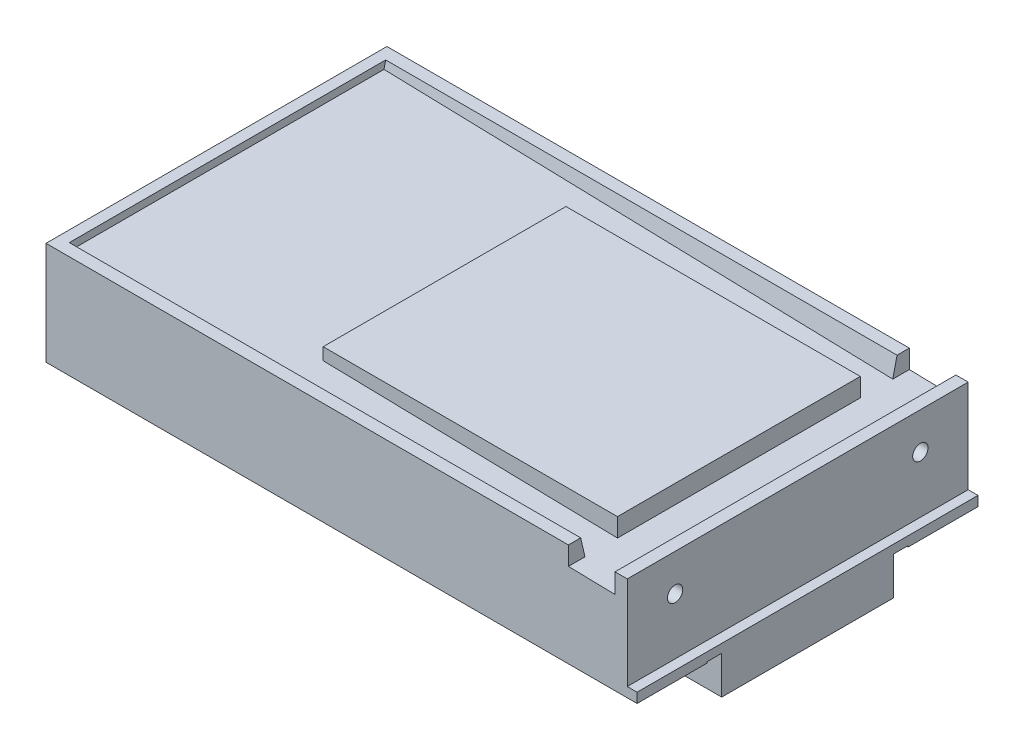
ISO-10303-21;
HEADER;
FILE_DESCRIPTION(('STEP AP214'),'2;1');
FILE_NAME('part.step','',(''),(''),'','','');
FILE_SCHEMA(('AUTOMOTIVE_DESIGN { 1 0 10303 214 1 1 1 1 }'));
ENDSEC;
DATA;
#1=APPLICATION_CONTEXT('core data for automotive mechanical design processes');
#2=APPLICATION_PROTOCOL_DEFINITION('international standard','automotive_design',2000,#1);
#3=PRODUCT_CONTEXT('',#1,'mechanical');
#4=PRODUCT('Part','Part','',(#3));
#5=PRODUCT_RELATED_PRODUCT_CATEGORY('part','',(#4));
#6=PRODUCT_DEFINITION_FORMATION('','',#4);
#7=PRODUCT_DEFINITION_CONTEXT('part definition',#1,'design');
#8=PRODUCT_DEFINITION('design','',#6,#7);
#9=PRODUCT_DEFINITION_SHAPE('','',#8);
#10=(LENGTH_UNIT() NAMED_UNIT(*) SI_UNIT(.MILLI.,.METRE.));
#11=(NAMED_UNIT(*) PLANE_ANGLE_UNIT() SI_UNIT($,.RADIAN.));
#12=(NAMED_UNIT(*) SI_UNIT($,.STERADIAN.) SOLID_ANGLE_UNIT());
#13=UNCERTAINTY_MEASURE_WITH_UNIT(LENGTH_MEASURE(1.E-05),#10,'distance_accuracy_value','');
#14=(GEOMETRIC_REPRESENTATION_CONTEXT(3) GLOBAL_UNCERTAINTY_ASSIGNED_CONTEXT((#13)) GLOBAL_UNIT_ASSIGNED_CONTEXT((#10,
#11,#12)) REPRESENTATION_CONTEXT('',''));
#15=CARTESIAN_POINT('',(0.,0.,0.));
#16=DIRECTION('',(0.,0.,1.));
#17=DIRECTION('',(1.,0.,0.));
#18=AXIS2_PLACEMENT_3D('',#15,#16,#17);
#19=CARTESIAN_POINT('',(93.,57.,-69.5));
#20=DIRECTION('',(-1.,0.,0.));
#21=DIRECTION('',(0.,-1.,0.));
#22=AXIS2_PLACEMENT_3D('',#19,#20,#21);
#23=PLANE('',#22);
#24=DIRECTION('',(0.,0.,1.));
#25=VECTOR('',#24,1.);
#26=CARTESIAN_POINT('',(93.,57.,-69.5));
#27=LINE('',#26,#25);
#28=CARTESIAN_POINT('',(93.,57.,-49.5));
#29=VERTEX_POINT('',#28);
#30=CARTESIAN_POINT('',(93.,57.,49.5));
#31=VERTEX_POINT('',#30);
#32=EDGE_CURVE('E865',#29,#31,#27,.T.);
#33=ORIENTED_EDGE('',*,*,#32,.F.);
#34=DIRECTION('',(0.,-1.,0.));
#35=VECTOR('',#34,1.);
#36=CARTESIAN_POINT('',(93.,57.,-49.5));
#37=LINE('',#36,#35);
#38=CARTESIAN_POINT('',(93.,52.0549450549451,-49.5));
#39=VERTEX_POINT('',#38);
#40=EDGE_CURVE('E791',#29,#39,#37,.T.);
#41=ORIENTED_EDGE('',*,*,#40,.T.);
#42=DIRECTION('',(0.,0.,1.));
#43=VECTOR('',#42,1.);
#44=CARTESIAN_POINT('',(93.,52.0549450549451,-69.5));
#45=LINE('',#44,#43);
#46=CARTESIAN_POINT('',(93.,52.0549450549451,49.5));
#47=VERTEX_POINT('',#46);
#48=EDGE_CURVE('E863',#39,#47,#45,.T.);
#49=ORIENTED_EDGE('',*,*,#48,.T.);
#50=DIRECTION('',(0.,1.,0.));
#51=VECTOR('',#50,1.);
#52=CARTESIAN_POINT('',(93.,57.,49.5));
#53=LINE('',#52,#51);
#54=EDGE_CURVE('E803',#47,#31,#53,.T.);
#55=ORIENTED_EDGE('',*,*,#54,.T.);
#56=EDGE_LOOP('',(#33,#41,#49,#55));
#57=FACE_BOUND('',#56,.T.);
#58=ADVANCED_FACE('F356',(#57),#23,.T.);
#59=CARTESIAN_POINT('',(213.,57.,-69.5));
#60=DIRECTION('',(0.,1.,0.));
#61=DIRECTION('',(-1.,0.,0.));
#62=AXIS2_PLACEMENT_3D('',#59,#60,#61);
#63=PLANE('',#62);
#64=DIRECTION('',(0.,0.,1.));
#65=VECTOR('',#64,1.);
#66=CARTESIAN_POINT('',(213.,57.,-69.5));
#67=LINE('',#66,#65);
#68=CARTESIAN_POINT('',(213.,57.,-49.5));
#69=VERTEX_POINT('',#68);
#70=CARTESIAN_POINT('',(213.,57.,49.5));
#71=VERTEX_POINT('',#70);
#72=EDGE_CURVE('E867',#69,#71,#67,.T.);
#73=ORIENTED_EDGE('',*,*,#72,.F.);
#74=DIRECTION('',(-1.,0.,0.));
#75=VECTOR('',#74,1.);
#76=CARTESIAN_POINT('',(213.,57.,-49.5));
#77=LINE('',#76,#75);
#78=EDGE_CURVE('E788',#69,#29,#77,.T.);
#79=ORIENTED_EDGE('',*,*,#78,.T.);
#80=ORIENTED_EDGE('',*,*,#32,.T.);
#81=DIRECTION('',(1.,0.,0.));
#82=VECTOR('',#81,1.);
#83=CARTESIAN_POINT('',(213.,57.,49.5));
#84=LINE('',#83,#82);
#85=EDGE_CURVE('E800',#31,#71,#84,.T.);
#86=ORIENTED_EDGE('',*,*,#85,.T.);
#87=EDGE_LOOP('',(#73,#79,#80,#86));
#88=FACE_BOUND('',#87,.T.);
#89=ADVANCED_FACE('F936',(#88),#63,.T.);
#90=CARTESIAN_POINT('',(213.,49.4175824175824,-69.5));
#91=DIRECTION('',(1.,0.,0.));
#92=DIRECTION('',(0.,1.,0.));
#93=AXIS2_PLACEMENT_3D('',#90,#91,#92);
#94=PLANE('',#93);
#95=DIRECTION('',(0.,0.,1.));
#96=VECTOR('',#95,1.);
#97=CARTESIAN_POINT('',(213.,49.4175824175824,-69.5));
#98=LINE('',#97,#96);
#99=CARTESIAN_POINT('',(213.,49.4175824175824,-49.5));
#100=VERTEX_POINT('',#99);
#101=CARTESIAN_POINT('',(213.,49.4175824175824,49.5));
#102=VERTEX_POINT('',#101);
#103=EDGE_CURVE('E869',#100,#102,#98,.T.);
#104=ORIENTED_EDGE('',*,*,#103,.F.);
#105=DIRECTION('',(0.,1.,0.));
#106=VECTOR('',#105,1.);
#107=CARTESIAN_POINT('',(213.,49.4175824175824,-49.5));
#108=LINE('',#107,#106);
#109=EDGE_CURVE('E785',#100,#69,#108,.T.);
#110=ORIENTED_EDGE('',*,*,#109,.T.);
#111=ORIENTED_EDGE('',*,*,#72,.T.);
#112=DIRECTION('',(0.,-1.,0.));
#113=VECTOR('',#112,1.);
#114=CARTESIAN_POINT('',(213.,49.4175824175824,49.5));
#115=LINE('',#114,#113);
#116=EDGE_CURVE('E797',#71,#102,#115,.T.);
#117=ORIENTED_EDGE('',*,*,#116,.T.);
#118=EDGE_LOOP('',(#104,#110,#111,#117));
#119=FACE_BOUND('',#118,.T.);
#120=ADVANCED_FACE('F943',(#119),#94,.T.);
#121=CARTESIAN_POINT('',(241.,0.,69.5));
#122=DIRECTION('',(0.,0.,1.));
#123=DIRECTION('',(1.,0.,0.));
#124=AXIS2_PLACEMENT_3D('',#121,#122,#123);
#125=PLANE('',#124);
#126=DIRECTION('',(-1.,0.,0.));
#127=VECTOR('',#126,1.);
#128=CARTESIAN_POINT('',(241.,15.,69.5));
#129=LINE('',#128,#127);
#130=CARTESIAN_POINT('',(241.,15.,69.5));
#131=VERTEX_POINT('',#130);
#132=CARTESIAN_POINT('',(0.,15.,69.5));
#133=VERTEX_POINT('',#132);
#134=EDGE_CURVE('E729',#131,#133,#129,.T.);
#135=ORIENTED_EDGE('',*,*,#134,.F.);
#136=DIRECTION('',(0.,1.,0.));
#137=VECTOR('',#136,1.);
#138=CARTESIAN_POINT('',(241.,0.,69.5));
#139=LINE('',#138,#137);
#140=CARTESIAN_POINT('',(241.,19.,69.5));
#141=VERTEX_POINT('',#140);
#142=EDGE_CURVE('E806',#131,#141,#139,.T.);
#143=ORIENTED_EDGE('',*,*,#142,.T.);
#144=DIRECTION('',(-1.,0.,0.));
#145=VECTOR('',#144,1.);
#146=CARTESIAN_POINT('',(241.,19.,69.5));
#147=LINE('',#146,#145);
#148=CARTESIAN_POINT('',(237.,19.,69.5));
#149=VERTEX_POINT('',#148);
#150=EDGE_CURVE('E808',#141,#149,#147,.T.);
#151=ORIENTED_EDGE('',*,*,#150,.T.);
#152=DIRECTION('',(0.,1.,0.));
#153=VECTOR('',#152,1.);
#154=CARTESIAN_POINT('',(237.,19.,69.5));
#155=LINE('',#154,#153);
#156=CARTESIAN_POINT('',(237.,57.,69.5));
#157=VERTEX_POINT('',#156);
#158=EDGE_CURVE('E811',#149,#157,#155,.T.);
#159=ORIENTED_EDGE('',*,*,#158,.T.);
#160=DIRECTION('',(-1.,0.,0.));
#161=VECTOR('',#160,1.);
#162=CARTESIAN_POINT('',(237.,57.,69.5));
#163=LINE('',#162,#161);
#164=CARTESIAN_POINT('',(232.,57.,69.5));
#165=VERTEX_POINT('',#164);
#166=EDGE_CURVE('E814',#157,#165,#163,.T.);
#167=ORIENTED_EDGE('',*,*,#166,.T.);
#168=DIRECTION('',(0.,-1.,0.));
#169=VECTOR('',#168,1.);
#170=CARTESIAN_POINT('',(232.,57.,69.5));
#171=LINE('',#170,#169);
#172=CARTESIAN_POINT('',(232.,49.,69.5));
#173=VERTEX_POINT('',#172);
#174=EDGE_CURVE('E817',#165,#173,#171,.T.);
#175=ORIENTED_EDGE('',*,*,#174,.T.);
#176=DIRECTION('',(-0.999758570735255,0.0219727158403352,0.));
#177=VECTOR('',#176,1.);
#178=CARTESIAN_POINT('',(93.,52.0549450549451,69.5));
#179=LINE('',#178,#177);
#180=CARTESIAN_POINT('',(213.,49.4175824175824,69.5));
#181=VERTEX_POINT('',#180);
#182=EDGE_CURVE('E820',#173,#181,#179,.T.);
#183=ORIENTED_EDGE('',*,*,#182,.T.);
#184=DIRECTION('',(0.,1.,0.));
#185=VECTOR('',#184,1.);
#186=CARTESIAN_POINT('',(213.,44.,69.5));
#187=LINE('',#186,#185);
#188=CARTESIAN_POINT('',(213.,57.,69.5));
#189=VERTEX_POINT('',#188);
#190=EDGE_CURVE('E773',#181,#189,#187,.T.);
#191=ORIENTED_EDGE('',*,*,#190,.T.);
#192=DIRECTION('',(-1.,0.,0.));
#193=VECTOR('',#192,1.);
#194=CARTESIAN_POINT('',(4.5,57.,69.5));
#195=LINE('',#194,#193);
#196=CARTESIAN_POINT('',(0.,57.,69.5));
#197=VERTEX_POINT('',#196);
#198=EDGE_CURVE('E823',#189,#197,#195,.T.);
#199=ORIENTED_EDGE('',*,*,#198,.T.);
#200=DIRECTION('',(0.,-1.,0.));
#201=VECTOR('',#200,1.);
#202=CARTESIAN_POINT('',(0.,57.,69.5));
#203=LINE('',#202,#201);
#204=EDGE_CURVE('E826',#197,#133,#203,.T.);
#205=ORIENTED_EDGE('',*,*,#204,.T.);
#206=EDGE_LOOP('',(#135,#143,#151,#159,#167,#175,#183,#191,#199,#205));
#207=FACE_BOUND('',#206,.T.);
#208=ADVANCED_FACE('F953',(#207),#125,.T.);
#209=CARTESIAN_POINT('',(0.,0.,-69.5));
#210=DIRECTION('',(0.,-1.,0.));
#211=DIRECTION('',(0.,0.,-1.));
#212=AXIS2_PLACEMENT_3D('',#209,#210,#211);
#213=PLANE('',#212);
#214=CARTESIAN_POINT('',(229.,0.,-25.5));
#215=DIRECTION('',(0.,-1.,0.));
#216=DIRECTION('',(0.,0.,-1.));
#217=AXIS2_PLACEMENT_3D('',#214,#215,#216);
#218=CIRCLE('',#217,5.);
#219=CARTESIAN_POINT('',(229.,0.,-30.5));
#220=VERTEX_POINT('',#219);
#221=EDGE_CURVE('E606',#220,#220,#218,.T.);
#222=ORIENTED_EDGE('',*,*,#221,.F.);
#223=EDGE_LOOP('',(#222));
#224=FACE_BOUND('',#223,.T.);
#225=CARTESIAN_POINT('',(229.,0.,25.));
#226=DIRECTION('',(0.,-1.,0.));
#227=DIRECTION('',(0.,0.,-1.));
#228=AXIS2_PLACEMENT_3D('',#225,#226,#227);
#229=CIRCLE('',#228,5.);
#230=CARTESIAN_POINT('',(229.,0.,20.));
#231=VERTEX_POINT('',#230);
#232=EDGE_CURVE('E617',#231,#231,#229,.T.);
#233=ORIENTED_EDGE('',*,*,#232,.F.);
#234=EDGE_LOOP('',(#233));
#235=FACE_BOUND('',#234,.T.);
#236=DIRECTION('',(0.,0.,-1.));
#237=VECTOR('',#236,1.);
#238=CARTESIAN_POINT('',(213.3,0.,-29.));
#239=LINE('',#238,#237);
#240=CARTESIAN_POINT('',(213.3,0.,29.));
#241=VERTEX_POINT('',#240);
#242=CARTESIAN_POINT('',(213.3,0.,-29.));
#243=VERTEX_POINT('',#242);
#244=EDGE_CURVE('E671',#241,#243,#239,.T.);
#245=ORIENTED_EDGE('',*,*,#244,.T.);
#246=DIRECTION('',(-1.,0.,0.));
#247=VECTOR('',#246,1.);
#248=CARTESIAN_POINT('',(213.3,0.,-29.));
#249=LINE('',#248,#247);
#250=CARTESIAN_POINT('',(13.,0.,-29.));
#251=VERTEX_POINT('',#250);
#252=EDGE_CURVE('E707',#243,#251,#249,.T.);
#253=ORIENTED_EDGE('',*,*,#252,.T.);
#254=DIRECTION('',(0.,0.,-1.));
#255=VECTOR('',#254,1.);
#256=CARTESIAN_POINT('',(13.,0.,-29.));
#257=LINE('',#256,#255);
#258=CARTESIAN_POINT('',(13.,0.,29.));
#259=VERTEX_POINT('',#258);
#260=EDGE_CURVE('E651',#259,#251,#257,.T.);
#261=ORIENTED_EDGE('',*,*,#260,.F.);
#262=DIRECTION('',(-1.,0.,0.));
#263=VECTOR('',#262,1.);
#264=CARTESIAN_POINT('',(213.3,0.,29.));
#265=LINE('',#264,#263);
#266=EDGE_CURVE('E378',#241,#259,#265,.T.);
#267=ORIENTED_EDGE('',*,*,#266,.F.);
#268=EDGE_LOOP('',(#245,#253,#261,#267));
#269=FACE_BOUND('',#268,.T.);
#270=DIRECTION('',(1.,0.,0.));
#271=VECTOR('',#270,1.);
#272=CARTESIAN_POINT('',(0.,0.,35.));
#273=LINE('',#272,#271);
#274=CARTESIAN_POINT('',(0.,0.,35.));
#275=VERTEX_POINT('',#274);
#276=CARTESIAN_POINT('',(241.,0.,35.));
#277=VERTEX_POINT('',#276);
#278=EDGE_CURVE('E724',#275,#277,#273,.T.);
#279=ORIENTED_EDGE('',*,*,#278,.F.);
#280=DIRECTION('',(0.,0.,1.));
#281=VECTOR('',#280,1.);
#282=CARTESIAN_POINT('',(0.,0.,-69.5));
#283=LINE('',#282,#281);
#284=CARTESIAN_POINT('',(0.,0.,-35.));
#285=VERTEX_POINT('',#284);
#286=EDGE_CURVE('E853',#285,#275,#283,.T.);
#287=ORIENTED_EDGE('',*,*,#286,.F.);
#288=DIRECTION('',(-1.,0.,0.));
#289=VECTOR('',#288,1.);
#290=CARTESIAN_POINT('',(0.,0.,-35.));
#291=LINE('',#290,#289);
#292=CARTESIAN_POINT('',(241.,0.,-35.));
#293=VERTEX_POINT('',#292);
#294=EDGE_CURVE('E750',#293,#285,#291,.T.);
#295=ORIENTED_EDGE('',*,*,#294,.F.);
#296=DIRECTION('',(0.,0.,1.));
#297=VECTOR('',#296,1.);
#298=CARTESIAN_POINT('',(241.,0.,-69.5));
#299=LINE('',#298,#297);
#300=EDGE_CURVE('E852',#293,#277,#299,.T.);
#301=ORIENTED_EDGE('',*,*,#300,.T.);
#302=EDGE_LOOP('',(#279,#287,#295,#301));
#303=FACE_BOUND('',#302,.T.);
#304=ADVANCED_FACE('F358',(#224,#235,#269,#303),#213,.T.);
#305=CARTESIAN_POINT('',(0.,57.,-69.5));
#306=DIRECTION('',(-1.,0.,0.));
#307=DIRECTION('',(0.,-1.,0.));
#308=AXIS2_PLACEMENT_3D('',#305,#306,#307);
#309=PLANE('',#308);
#310=CARTESIAN_POINT('',(0.,24.,0.));
#311=DIRECTION('',(-1.,0.,0.));
#312=DIRECTION('',(0.,-1.,0.));
#313=AXIS2_PLACEMENT_3D('',#310,#311,#312);
#314=CIRCLE('',#313,13.5);
#315=CARTESIAN_POINT('',(0.,10.5,0.));
#316=VERTEX_POINT('',#315);
#317=EDGE_CURVE('E13',#316,#316,#314,.F.);
#318=ORIENTED_EDGE('',*,*,#317,.T.);
#319=EDGE_LOOP('',(#318));
#320=FACE_BOUND('',#319,.T.);
#321=CARTESIAN_POINT('',(0.,24.,-27.));
#322=DIRECTION('',(-1.,0.,0.));
#323=DIRECTION('',(0.,0.,1.));
#324=AXIS2_PLACEMENT_3D('',#321,#322,#323);
#325=CIRCLE('',#324,4.);
#326=CARTESIAN_POINT('',(0.,24.,-23.));
#327=VERTEX_POINT('',#326);
#328=EDGE_CURVE('E635',#327,#327,#325,.T.);
#329=ORIENTED_EDGE('',*,*,#328,.F.);
#330=EDGE_LOOP('',(#329));
#331=FACE_BOUND('',#330,.T.);
#332=CARTESIAN_POINT('',(0.,24.,27.));
#333=DIRECTION('',(-1.,0.,0.));
#334=DIRECTION('',(0.,0.,1.));
#335=AXIS2_PLACEMENT_3D('',#332,#333,#334);
#336=CIRCLE('',#335,4.);
#337=CARTESIAN_POINT('',(0.,24.,31.));
#338=VERTEX_POINT('',#337);
#339=EDGE_CURVE('E645',#338,#338,#336,.T.);
#340=ORIENTED_EDGE('',*,*,#339,.F.);
#341=EDGE_LOOP('',(#340));
#342=FACE_BOUND('',#341,.T.);
#343=DIRECTION('',(0.,0.,-1.));
#344=VECTOR('',#343,1.);
#345=CARTESIAN_POINT('',(0.,15.,41.));
#346=LINE('',#345,#344);
#347=CARTESIAN_POINT('',(0.,15.,41.));
#348=VERTEX_POINT('',#347);
#349=EDGE_CURVE('E715',#133,#348,#346,.T.);
#350=ORIENTED_EDGE('',*,*,#349,.F.);
#351=ORIENTED_EDGE('',*,*,#204,.F.);
#352=DIRECTION('',(0.,0.,1.));
#353=VECTOR('',#352,1.);
#354=CARTESIAN_POINT('',(0.,57.,-69.5));
#355=LINE('',#354,#353);
#356=CARTESIAN_POINT('',(0.,57.,-69.5));
#357=VERTEX_POINT('',#356);
#358=EDGE_CURVE('E857',#357,#197,#355,.T.);
#359=ORIENTED_EDGE('',*,*,#358,.F.);
#360=DIRECTION('',(0.,-1.,0.));
#361=VECTOR('',#360,1.);
#362=CARTESIAN_POINT('',(0.,57.,-69.5));
#363=LINE('',#362,#361);
#364=CARTESIAN_POINT('',(0.,15.,-69.5));
#365=VERTEX_POINT('',#364);
#366=EDGE_CURVE('E849',#357,#365,#363,.T.);
#367=ORIENTED_EDGE('',*,*,#366,.T.);
#368=DIRECTION('',(0.,0.,-1.));
#369=VECTOR('',#368,1.);
#370=CARTESIAN_POINT('',(0.,15.,-41.));
#371=LINE('',#370,#369);
#372=CARTESIAN_POINT('',(0.,15.,-41.));
#373=VERTEX_POINT('',#372);
#374=EDGE_CURVE('E740',#373,#365,#371,.T.);
#375=ORIENTED_EDGE('',*,*,#374,.F.);
#376=DIRECTION('',(0.,-1.,0.));
#377=VECTOR('',#376,1.);
#378=CARTESIAN_POINT('',(0.,15.5,-41.));
#379=LINE('',#378,#377);
#380=CARTESIAN_POINT('',(0.,15.5,-41.));
#381=VERTEX_POINT('',#380);
#382=EDGE_CURVE('E737',#381,#373,#379,.T.);
#383=ORIENTED_EDGE('',*,*,#382,.F.);
#384=DIRECTION('',(0.,0.,-1.));
#385=VECTOR('',#384,1.);
#386=CARTESIAN_POINT('',(0.,15.5,-35.));
#387=LINE('',#386,#385);
#388=CARTESIAN_POINT('',(0.,15.5,-35.));
#389=VERTEX_POINT('',#388);
#390=EDGE_CURVE('E734',#389,#381,#387,.T.);
#391=ORIENTED_EDGE('',*,*,#390,.F.);
#392=DIRECTION('',(0.,1.,0.));
#393=VECTOR('',#392,1.);
#394=CARTESIAN_POINT('',(0.,15.5,-35.));
#395=LINE('',#394,#393);
#396=EDGE_CURVE('E731',#285,#389,#395,.T.);
#397=ORIENTED_EDGE('',*,*,#396,.F.);
#398=ORIENTED_EDGE('',*,*,#286,.T.);
#399=DIRECTION('',(0.,-1.,0.));
#400=VECTOR('',#399,1.);
#401=CARTESIAN_POINT('',(0.,-2.78075264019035,35.));
#402=LINE('',#401,#400);
#403=CARTESIAN_POINT('',(0.,15.5,35.));
#404=VERTEX_POINT('',#403);
#405=EDGE_CURVE('E713',#404,#275,#402,.T.);
#406=ORIENTED_EDGE('',*,*,#405,.F.);
#407=DIRECTION('',(0.,0.,-1.));
#408=VECTOR('',#407,1.);
#409=CARTESIAN_POINT('',(0.,15.5,35.));
#410=LINE('',#409,#408);
#411=CARTESIAN_POINT('',(0.,15.5,41.));
#412=VERTEX_POINT('',#411);
#413=EDGE_CURVE('E710',#412,#404,#410,.T.);
#414=ORIENTED_EDGE('',*,*,#413,.F.);
#415=DIRECTION('',(0.,1.,0.));
#416=VECTOR('',#415,1.);
#417=CARTESIAN_POINT('',(0.,15.5,41.));
#418=LINE('',#417,#416);
#419=EDGE_CURVE('E718',#348,#412,#418,.T.);
#420=ORIENTED_EDGE('',*,*,#419,.F.);
#421=EDGE_LOOP('',(#350,#351,#359,#367,#375,#383,#391,#397,#398,#406,#414,#420));
#422=FACE_BOUND('',#421,.T.);
#423=ADVANCED_FACE('F993',(#320,#331,#342,#422),#309,.T.);
#424=CARTESIAN_POINT('',(4.5,57.,-69.5));
#425=DIRECTION('',(0.,1.,0.));
#426=DIRECTION('',(0.,0.,1.));
#427=AXIS2_PLACEMENT_3D('',#424,#425,#426);
#428=PLANE('',#427);
#429=DIRECTION('',(0.,0.,1.));
#430=VECTOR('',#429,1.);
#431=CARTESIAN_POINT('',(4.5,57.,-69.5));
#432=LINE('',#431,#430);
#433=CARTESIAN_POINT('',(4.5,57.,-64.5));
#434=VERTEX_POINT('',#433);
#435=CARTESIAN_POINT('',(4.5,57.,64.5));
#436=VERTEX_POINT('',#435);
#437=EDGE_CURVE('E859',#434,#436,#432,.T.);
#438=ORIENTED_EDGE('',*,*,#437,.F.);
#439=DIRECTION('',(-1.,0.,0.));
#440=VECTOR('',#439,1.);
#441=CARTESIAN_POINT('',(213.,57.,-64.5));
#442=LINE('',#441,#440);
#443=CARTESIAN_POINT('',(213.,57.,-64.5));
#444=VERTEX_POINT('',#443);
#445=EDGE_CURVE('E760',#444,#434,#442,.T.);
#446=ORIENTED_EDGE('',*,*,#445,.F.);
#447=DIRECTION('',(0.,0.,-1.));
#448=VECTOR('',#447,1.);
#449=CARTESIAN_POINT('',(213.,57.,-69.5));
#450=LINE('',#449,#448);
#451=CARTESIAN_POINT('',(213.,57.,-69.5));
#452=VERTEX_POINT('',#451);
#453=EDGE_CURVE('E752',#444,#452,#450,.T.);
#454=ORIENTED_EDGE('',*,*,#453,.T.);
#455=DIRECTION('',(-1.,0.,0.));
#456=VECTOR('',#455,1.);
#457=CARTESIAN_POINT('',(4.5,57.,-69.5));
#458=LINE('',#457,#456);
#459=EDGE_CURVE('E846',#452,#357,#458,.T.);
#460=ORIENTED_EDGE('',*,*,#459,.T.);
#461=ORIENTED_EDGE('',*,*,#358,.T.);
#462=ORIENTED_EDGE('',*,*,#198,.F.);
#463=DIRECTION('',(0.,0.,-1.));
#464=VECTOR('',#463,1.);
#465=CARTESIAN_POINT('',(213.,57.,69.5));
#466=LINE('',#465,#464);
#467=CARTESIAN_POINT('',(213.,57.,64.5));
#468=VERTEX_POINT('',#467);
#469=EDGE_CURVE('E767',#189,#468,#466,.T.);
#470=ORIENTED_EDGE('',*,*,#469,.T.);
#471=DIRECTION('',(-1.,0.,0.));
#472=VECTOR('',#471,1.);
#473=CARTESIAN_POINT('',(213.,57.,64.5));
#474=LINE('',#473,#472);
#475=EDGE_CURVE('E776',#468,#436,#474,.T.);
#476=ORIENTED_EDGE('',*,*,#475,.T.);
#477=EDGE_LOOP('',(#438,#446,#454,#460,#461,#462,#470,#476));
#478=FACE_BOUND('',#477,.T.);
#479=ADVANCED_FACE('F1049',(#478),#428,.T.);
#480=CARTESIAN_POINT('',(4.5,54.,-69.5));
#481=DIRECTION('',(1.,0.,0.));
#482=DIRECTION('',(0.,0.,-1.));
#483=AXIS2_PLACEMENT_3D('',#480,#481,#482);
#484=PLANE('',#483);
#485=DIRECTION('',(0.,-0.97439119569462,0.224859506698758));
#486=VECTOR('',#485,1.);
#487=CARTESIAN_POINT('',(4.5,55.247191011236,-64.0955056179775));
#488=LINE('',#487,#486);
#489=CARTESIAN_POINT('',(4.5,54.,-63.8076923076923));
#490=VERTEX_POINT('',#489);
#491=EDGE_CURVE('E765',#434,#490,#488,.T.);
#492=ORIENTED_EDGE('',*,*,#491,.F.);
#493=ORIENTED_EDGE('',*,*,#437,.T.);
#494=DIRECTION('',(0.,0.97439119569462,0.224859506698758));
#495=VECTOR('',#494,1.);
#496=CARTESIAN_POINT('',(4.5,24.7921348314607,57.0674157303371));
#497=LINE('',#496,#495);
#498=CARTESIAN_POINT('',(4.5,54.,63.8076923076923));
#499=VERTEX_POINT('',#498);
#500=EDGE_CURVE('E779',#499,#436,#497,.T.);
#501=ORIENTED_EDGE('',*,*,#500,.F.);
#502=DIRECTION('',(0.,0.,1.));
#503=VECTOR('',#502,1.);
#504=CARTESIAN_POINT('',(4.5,54.,-69.5));
#505=LINE('',#504,#503);
#506=EDGE_CURVE('E861',#490,#499,#505,.T.);
#507=ORIENTED_EDGE('',*,*,#506,.F.);
#508=EDGE_LOOP('',(#492,#493,#501,#507));
#509=FACE_BOUND('',#508,.T.);
#510=ADVANCED_FACE('F1063',(#509),#484,.T.);
#511=CARTESIAN_POINT('',(93.,52.0549450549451,-69.5));
#512=DIRECTION('',(0.0219727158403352,0.999758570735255,0.));
#513=DIRECTION('',(-0.999758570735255,0.0219727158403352,0.));
#514=AXIS2_PLACEMENT_3D('',#511,#512,#513);
#515=PLANE('',#514);
#516=DIRECTION('',(0.999745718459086,-0.0219724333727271,0.00507056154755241));
#517=VECTOR('',#516,1.);
#518=CARTESIAN_POINT('',(92.9688687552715,52.0556292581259,-63.3589913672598));
#519=LINE('',#518,#517);
#520=CARTESIAN_POINT('',(213.,49.4175824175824,-62.7502113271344));
#521=VERTEX_POINT('',#520);
#522=EDGE_CURVE('E890',#490,#521,#519,.T.);
#523=ORIENTED_EDGE('',*,*,#522,.F.);
#524=ORIENTED_EDGE('',*,*,#506,.T.);
#525=DIRECTION('',(-0.999745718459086,0.0219724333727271,0.00507056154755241));
#526=VECTOR('',#525,1.);
#527=CARTESIAN_POINT('',(93.673497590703,52.0401429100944,63.3554175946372));
#528=LINE('',#527,#526);
#529=CARTESIAN_POINT('',(213.,49.4175824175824,62.7502113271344));
#530=VERTEX_POINT('',#529);
#531=EDGE_CURVE('E887',#530,#499,#528,.T.);
#532=ORIENTED_EDGE('',*,*,#531,.F.);
#533=DIRECTION('',(0.,0.,-1.));
#534=VECTOR('',#533,1.);
#535=CARTESIAN_POINT('',(213.,49.4175824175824,-69.5));
#536=LINE('',#535,#534);
#537=EDGE_CURVE('E856',#181,#530,#536,.T.);
#538=ORIENTED_EDGE('',*,*,#537,.F.);
#539=ORIENTED_EDGE('',*,*,#182,.F.);
#540=DIRECTION('',(0.,0.,1.));
#541=VECTOR('',#540,1.);
#542=CARTESIAN_POINT('',(232.,49.,-69.5));
#543=LINE('',#542,#541);
#544=CARTESIAN_POINT('',(232.,49.,-69.5));
#545=VERTEX_POINT('',#544);
#546=EDGE_CURVE('E871',#545,#173,#543,.T.);
#547=ORIENTED_EDGE('',*,*,#546,.F.);
#548=DIRECTION('',(-0.999758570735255,0.0219727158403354,0.));
#549=VECTOR('',#548,1.);
#550=CARTESIAN_POINT('',(232.,49.,-69.5));
#551=LINE('',#550,#549);
#552=CARTESIAN_POINT('',(213.,49.4175824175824,-69.5));
#553=VERTEX_POINT('',#552);
#554=EDGE_CURVE('E843',#545,#553,#551,.T.);
#555=ORIENTED_EDGE('',*,*,#554,.T.);
#556=DIRECTION('',(0.,0.,1.));
#557=VECTOR('',#556,1.);
#558=CARTESIAN_POINT('',(213.,49.4175824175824,-69.5));
#559=LINE('',#558,#557);
#560=EDGE_CURVE('E762',#553,#521,#559,.T.);
#561=ORIENTED_EDGE('',*,*,#560,.T.);
#562=EDGE_LOOP('',(#523,#524,#532,#538,#539,#547,#555,#561));
#563=FACE_BOUND('',#562,.T.);
#564=ORIENTED_EDGE('',*,*,#48,.F.);
#565=DIRECTION('',(0.999758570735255,-0.0219727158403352,0.));
#566=VECTOR('',#565,1.);
#567=CARTESIAN_POINT('',(68.3317124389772,52.5971052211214,-49.5));
#568=LINE('',#567,#566);
#569=EDGE_CURVE('E782',#39,#100,#568,.T.);
#570=ORIENTED_EDGE('',*,*,#569,.T.);
#571=ORIENTED_EDGE('',*,*,#103,.T.);
#572=DIRECTION('',(-0.999758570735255,0.0219727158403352,0.));
#573=VECTOR('',#572,1.);
#574=CARTESIAN_POINT('',(68.3317124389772,52.5971052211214,49.5));
#575=LINE('',#574,#573);
#576=EDGE_CURVE('E794',#102,#47,#575,.T.);
#577=ORIENTED_EDGE('',*,*,#576,.T.);
#578=EDGE_LOOP('',(#564,#570,#571,#577));
#579=FACE_BOUND('',#578,.T.);
#580=ADVANCED_FACE('F948',(#563,#579),#515,.T.);
#581=CARTESIAN_POINT('',(232.,57.,-69.5));
#582=DIRECTION('',(-1.,0.,0.));
#583=DIRECTION('',(0.,0.,1.));
#584=AXIS2_PLACEMENT_3D('',#581,#582,#583);
#585=PLANE('',#584);
#586=ORIENTED_EDGE('',*,*,#174,.F.);
#587=DIRECTION('',(0.,0.,1.));
#588=VECTOR('',#587,1.);
#589=CARTESIAN_POINT('',(232.,57.,-69.5));
#590=LINE('',#589,#588);
#591=CARTESIAN_POINT('',(232.,57.,-69.5));
#592=VERTEX_POINT('',#591);
#593=EDGE_CURVE('E874',#592,#165,#590,.T.);
#594=ORIENTED_EDGE('',*,*,#593,.F.);
#595=DIRECTION('',(0.,-1.,0.));
#596=VECTOR('',#595,1.);
#597=CARTESIAN_POINT('',(232.,57.,-69.5));
#598=LINE('',#597,#596);
#599=EDGE_CURVE('E840',#592,#545,#598,.T.);
#600=ORIENTED_EDGE('',*,*,#599,.T.);
#601=ORIENTED_EDGE('',*,*,#546,.T.);
#602=EDGE_LOOP('',(#586,#594,#600,#601));
#603=FACE_BOUND('',#602,.T.);
#604=ADVANCED_FACE('F955',(#603),#585,.T.);
#605=CARTESIAN_POINT('',(237.,57.,-69.5));
#606=DIRECTION('',(0.,1.,0.));
#607=DIRECTION('',(0.,0.,1.));
#608=AXIS2_PLACEMENT_3D('',#605,#606,#607);
#609=PLANE('',#608);
#610=ORIENTED_EDGE('',*,*,#166,.F.);
#611=DIRECTION('',(0.,0.,1.));
#612=VECTOR('',#611,1.);
#613=CARTESIAN_POINT('',(237.,57.,-69.5));
#614=LINE('',#613,#612);
#615=CARTESIAN_POINT('',(237.,57.,-69.5));
#616=VERTEX_POINT('',#615);
#617=EDGE_CURVE('E876',#616,#157,#614,.T.);
#618=ORIENTED_EDGE('',*,*,#617,.F.);
#619=DIRECTION('',(-1.,0.,0.));
#620=VECTOR('',#619,1.);
#621=CARTESIAN_POINT('',(237.,57.,-69.5));
#622=LINE('',#621,#620);
#623=EDGE_CURVE('E837',#616,#592,#622,.T.);
#624=ORIENTED_EDGE('',*,*,#623,.T.);
#625=ORIENTED_EDGE('',*,*,#593,.T.);
#626=EDGE_LOOP('',(#610,#618,#624,#625));
#627=FACE_BOUND('',#626,.T.);
#628=ADVANCED_FACE('F958',(#627),#609,.T.);
#629=CARTESIAN_POINT('',(237.,19.,-69.5));
#630=DIRECTION('',(1.,0.,0.));
#631=DIRECTION('',(0.,0.,-1.));
#632=AXIS2_PLACEMENT_3D('',#629,#630,#631);
#633=PLANE('',#632);
#634=CARTESIAN_POINT('',(237.,42.,50.));
#635=DIRECTION('',(1.,0.,0.));
#636=DIRECTION('',(0.,0.,-1.));
#637=AXIS2_PLACEMENT_3D('',#634,#635,#636);
#638=CIRCLE('',#637,3.125);
#639=CARTESIAN_POINT('',(237.,42.,46.875));
#640=VERTEX_POINT('',#639);
#641=EDGE_CURVE('E623',#640,#640,#638,.T.);
#642=ORIENTED_EDGE('',*,*,#641,.F.);
#643=EDGE_LOOP('',(#642));
#644=FACE_BOUND('',#643,.T.);
#645=CARTESIAN_POINT('',(237.,42.,-50.));
#646=DIRECTION('',(1.,0.,0.));
#647=DIRECTION('',(0.,0.,-1.));
#648=AXIS2_PLACEMENT_3D('',#645,#646,#647);
#649=CIRCLE('',#648,3.125);
#650=CARTESIAN_POINT('',(237.,42.,-53.125));
#651=VERTEX_POINT('',#650);
#652=EDGE_CURVE('E629',#651,#651,#649,.T.);
#653=ORIENTED_EDGE('',*,*,#652,.F.);
#654=EDGE_LOOP('',(#653));
#655=FACE_BOUND('',#654,.T.);
#656=ORIENTED_EDGE('',*,*,#158,.F.);
#657=DIRECTION('',(0.,0.,1.));
#658=VECTOR('',#657,1.);
#659=CARTESIAN_POINT('',(237.,19.,-69.5));
#660=LINE('',#659,#658);
#661=CARTESIAN_POINT('',(237.,19.,-69.5));
#662=VERTEX_POINT('',#661);
#663=EDGE_CURVE('E878',#662,#149,#660,.T.);
#664=ORIENTED_EDGE('',*,*,#663,.F.);
#665=DIRECTION('',(0.,1.,0.));
#666=VECTOR('',#665,1.);
#667=CARTESIAN_POINT('',(237.,19.,-69.5));
#668=LINE('',#667,#666);
#669=EDGE_CURVE('E834',#662,#616,#668,.T.);
#670=ORIENTED_EDGE('',*,*,#669,.T.);
#671=ORIENTED_EDGE('',*,*,#617,.T.);
#672=EDGE_LOOP('',(#656,#664,#670,#671));
#673=FACE_BOUND('',#672,.T.);
#674=ADVANCED_FACE('F962',(#644,#655,#673),#633,.T.);
#675=CARTESIAN_POINT('',(241.,19.,-69.5));
#676=DIRECTION('',(0.,1.,0.));
#677=DIRECTION('',(0.,0.,1.));
#678=AXIS2_PLACEMENT_3D('',#675,#676,#677);
#679=PLANE('',#678);
#680=ORIENTED_EDGE('',*,*,#150,.F.);
#681=DIRECTION('',(0.,0.,1.));
#682=VECTOR('',#681,1.);
#683=CARTESIAN_POINT('',(241.,19.,-69.5));
#684=LINE('',#683,#682);
#685=CARTESIAN_POINT('',(241.,19.,-69.5));
#686=VERTEX_POINT('',#685);
#687=EDGE_CURVE('E880',#686,#141,#684,.T.);
#688=ORIENTED_EDGE('',*,*,#687,.F.);
#689=DIRECTION('',(-1.,0.,0.));
#690=VECTOR('',#689,1.);
#691=CARTESIAN_POINT('',(241.,19.,-69.5));
#692=LINE('',#691,#690);
#693=EDGE_CURVE('E831',#686,#662,#692,.T.);
#694=ORIENTED_EDGE('',*,*,#693,.T.);
#695=ORIENTED_EDGE('',*,*,#663,.T.);
#696=EDGE_LOOP('',(#680,#688,#694,#695));
#697=FACE_BOUND('',#696,.T.);
#698=ADVANCED_FACE('F966',(#697),#679,.T.);
#699=CARTESIAN_POINT('',(241.,0.,-69.5));
#700=DIRECTION('',(1.,0.,0.));
#701=DIRECTION('',(0.,0.,-1.));
#702=AXIS2_PLACEMENT_3D('',#699,#700,#701);
#703=PLANE('',#702);
#704=DIRECTION('',(0.,0.,1.));
#705=VECTOR('',#704,1.);
#706=CARTESIAN_POINT('',(241.,15.,-69.5));
#707=LINE('',#706,#705);
#708=CARTESIAN_POINT('',(241.,15.,41.));
#709=VERTEX_POINT('',#708);
#710=EDGE_CURVE('E908',#709,#131,#707,.T.);
#711=ORIENTED_EDGE('',*,*,#710,.F.);
#712=DIRECTION('',(0.,-1.,0.));
#713=VECTOR('',#712,1.);
#714=CARTESIAN_POINT('',(241.,0.,41.));
#715=LINE('',#714,#713);
#716=CARTESIAN_POINT('',(241.,15.5,41.));
#717=VERTEX_POINT('',#716);
#718=EDGE_CURVE('E906',#717,#709,#715,.T.);
#719=ORIENTED_EDGE('',*,*,#718,.F.);
#720=DIRECTION('',(0.,0.,1.));
#721=VECTOR('',#720,1.);
#722=CARTESIAN_POINT('',(241.,15.5000000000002,-69.5));
#723=LINE('',#722,#721);
#724=CARTESIAN_POINT('',(241.,15.5,35.));
#725=VERTEX_POINT('',#724);
#726=EDGE_CURVE('E904',#725,#717,#723,.T.);
#727=ORIENTED_EDGE('',*,*,#726,.F.);
#728=DIRECTION('',(0.,1.,0.));
#729=VECTOR('',#728,1.);
#730=CARTESIAN_POINT('',(241.,0.,35.));
#731=LINE('',#730,#729);
#732=EDGE_CURVE('E902',#277,#725,#731,.T.);
#733=ORIENTED_EDGE('',*,*,#732,.F.);
#734=ORIENTED_EDGE('',*,*,#300,.F.);
#735=DIRECTION('',(0.,-1.,0.));
#736=VECTOR('',#735,1.);
#737=CARTESIAN_POINT('',(241.,0.,-35.));
#738=LINE('',#737,#736);
#739=CARTESIAN_POINT('',(241.,15.5,-35.));
#740=VERTEX_POINT('',#739);
#741=EDGE_CURVE('E900',#740,#293,#738,.T.);
#742=ORIENTED_EDGE('',*,*,#741,.F.);
#743=DIRECTION('',(0.,0.,1.));
#744=VECTOR('',#743,1.);
#745=CARTESIAN_POINT('',(241.,15.5,-69.5));
#746=LINE('',#745,#744);
#747=CARTESIAN_POINT('',(241.,15.5,-41.));
#748=VERTEX_POINT('',#747);
#749=EDGE_CURVE('E896',#748,#740,#746,.T.);
#750=ORIENTED_EDGE('',*,*,#749,.F.);
#751=DIRECTION('',(0.,1.,0.));
#752=VECTOR('',#751,1.);
#753=CARTESIAN_POINT('',(241.,0.,-41.));
#754=LINE('',#753,#752);
#755=CARTESIAN_POINT('',(241.,15.,-41.));
#756=VERTEX_POINT('',#755);
#757=EDGE_CURVE('E898',#756,#748,#754,.T.);
#758=ORIENTED_EDGE('',*,*,#757,.F.);
#759=DIRECTION('',(0.,0.,1.));
#760=VECTOR('',#759,1.);
#761=CARTESIAN_POINT('',(241.,15.,-69.5));
#762=LINE('',#761,#760);
#763=CARTESIAN_POINT('',(241.,15.,-69.5));
#764=VERTEX_POINT('',#763);
#765=EDGE_CURVE('E745',#764,#756,#762,.T.);
#766=ORIENTED_EDGE('',*,*,#765,.F.);
#767=DIRECTION('',(0.,1.,0.));
#768=VECTOR('',#767,1.);
#769=CARTESIAN_POINT('',(241.,0.,-69.5));
#770=LINE('',#769,#768);
#771=EDGE_CURVE('E829',#764,#686,#770,.T.);
#772=ORIENTED_EDGE('',*,*,#771,.T.);
#773=ORIENTED_EDGE('',*,*,#687,.T.);
#774=ORIENTED_EDGE('',*,*,#142,.F.);
#775=EDGE_LOOP('',(#711,#719,#727,#733,#734,#742,#750,#758,#766,#772,#773,#774));
#776=FACE_BOUND('',#775,.T.);
#777=ADVANCED_FACE('F969',(#776),#703,.T.);
#778=CARTESIAN_POINT('',(241.,0.,-69.5));
#779=DIRECTION('',(0.,0.,1.));
#780=DIRECTION('',(1.,0.,0.));
#781=AXIS2_PLACEMENT_3D('',#778,#779,#780);
#782=PLANE('',#781);
#783=ORIENTED_EDGE('',*,*,#771,.F.);
#784=DIRECTION('',(-1.,0.,0.));
#785=VECTOR('',#784,1.);
#786=CARTESIAN_POINT('',(241.,15.,-69.5));
#787=LINE('',#786,#785);
#788=EDGE_CURVE('E893',#764,#365,#787,.T.);
#789=ORIENTED_EDGE('',*,*,#788,.T.);
#790=ORIENTED_EDGE('',*,*,#366,.F.);
#791=ORIENTED_EDGE('',*,*,#459,.F.);
#792=DIRECTION('',(0.,-1.,0.));
#793=VECTOR('',#792,1.);
#794=CARTESIAN_POINT('',(213.,44.,-69.5));
#795=LINE('',#794,#793);
#796=EDGE_CURVE('E755',#452,#553,#795,.T.);
#797=ORIENTED_EDGE('',*,*,#796,.T.);
#798=ORIENTED_EDGE('',*,*,#554,.F.);
#799=ORIENTED_EDGE('',*,*,#599,.F.);
#800=ORIENTED_EDGE('',*,*,#623,.F.);
#801=ORIENTED_EDGE('',*,*,#669,.F.);
#802=ORIENTED_EDGE('',*,*,#693,.F.);
#803=EDGE_LOOP('',(#783,#789,#790,#791,#797,#798,#799,#800,#801,#802));
#804=FACE_BOUND('',#803,.T.);
#805=ADVANCED_FACE('F972',(#804),#782,.F.);
#806=CARTESIAN_POINT('',(68.5514395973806,62.5946909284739,49.5));
#807=DIRECTION('',(0.,0.,1.));
#808=DIRECTION('',(1.,0.,0.));
#809=AXIS2_PLACEMENT_3D('',#806,#807,#808);
#810=PLANE('',#809);
#811=ORIENTED_EDGE('',*,*,#576,.F.);
#812=ORIENTED_EDGE('',*,*,#116,.F.);
#813=ORIENTED_EDGE('',*,*,#85,.F.);
#814=ORIENTED_EDGE('',*,*,#54,.F.);
#815=EDGE_LOOP('',(#811,#812,#813,#814));
#816=FACE_BOUND('',#815,.T.);
#817=ADVANCED_FACE('F978',(#816),#810,.T.);
#818=CARTESIAN_POINT('',(68.5514395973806,62.5946909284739,-49.5));
#819=DIRECTION('',(0.,0.,-1.));
#820=DIRECTION('',(-1.,0.,0.));
#821=AXIS2_PLACEMENT_3D('',#818,#819,#820);
#822=PLANE('',#821);
#823=ORIENTED_EDGE('',*,*,#78,.F.);
#824=ORIENTED_EDGE('',*,*,#109,.F.);
#825=ORIENTED_EDGE('',*,*,#569,.F.);
#826=ORIENTED_EDGE('',*,*,#40,.F.);
#827=EDGE_LOOP('',(#823,#824,#825,#826));
#828=FACE_BOUND('',#827,.T.);
#829=ADVANCED_FACE('F1067',(#828),#822,.T.);
#830=CARTESIAN_POINT('',(213.,57.,64.5));
#831=DIRECTION('',(0.,0.224859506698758,-0.97439119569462));
#832=DIRECTION('',(0.,0.97439119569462,0.224859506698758));
#833=AXIS2_PLACEMENT_3D('',#830,#831,#832);
#834=PLANE('',#833);
#835=ORIENTED_EDGE('',*,*,#531,.T.);
#836=ORIENTED_EDGE('',*,*,#500,.T.);
#837=ORIENTED_EDGE('',*,*,#475,.F.);
#838=DIRECTION('',(0.,-0.97439119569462,-0.224859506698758));
#839=VECTOR('',#838,1.);
#840=CARTESIAN_POINT('',(213.,57.,64.5));
#841=LINE('',#840,#839);
#842=EDGE_CURVE('E770',#468,#530,#841,.T.);
#843=ORIENTED_EDGE('',*,*,#842,.T.);
#844=EDGE_LOOP('',(#835,#836,#837,#843));
#845=FACE_BOUND('',#844,.T.);
#846=ADVANCED_FACE('F1065',(#845),#834,.T.);
#847=CARTESIAN_POINT('',(213.,57.,69.5));
#848=DIRECTION('',(1.,0.,0.));
#849=DIRECTION('',(0.,1.,0.));
#850=AXIS2_PLACEMENT_3D('',#847,#848,#849);
#851=PLANE('',#850);
#852=ORIENTED_EDGE('',*,*,#190,.F.);
#853=ORIENTED_EDGE('',*,*,#537,.T.);
#854=ORIENTED_EDGE('',*,*,#842,.F.);
#855=ORIENTED_EDGE('',*,*,#469,.F.);
#856=EDGE_LOOP('',(#852,#853,#854,#855));
#857=FACE_BOUND('',#856,.T.);
#858=ADVANCED_FACE('F1045',(#857),#851,.T.);
#859=CARTESIAN_POINT('',(213.,57.,-64.5));
#860=DIRECTION('',(0.,0.224859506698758,0.97439119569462));
#861=DIRECTION('',(0.,-0.97439119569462,0.224859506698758));
#862=AXIS2_PLACEMENT_3D('',#859,#860,#861);
#863=PLANE('',#862);
#864=ORIENTED_EDGE('',*,*,#445,.T.);
#865=ORIENTED_EDGE('',*,*,#491,.T.);
#866=ORIENTED_EDGE('',*,*,#522,.T.);
#867=DIRECTION('',(0.,0.97439119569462,-0.224859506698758));
#868=VECTOR('',#867,1.);
#869=CARTESIAN_POINT('',(213.,57.,-64.5));
#870=LINE('',#869,#868);
#871=EDGE_CURVE('E758',#521,#444,#870,.T.);
#872=ORIENTED_EDGE('',*,*,#871,.T.);
#873=EDGE_LOOP('',(#864,#865,#866,#872));
#874=FACE_BOUND('',#873,.T.);
#875=ADVANCED_FACE('F1072',(#874),#863,.T.);
#876=CARTESIAN_POINT('',(213.,57.,-69.5));
#877=DIRECTION('',(-1.,0.,0.));
#878=DIRECTION('',(0.,-1.,0.));
#879=AXIS2_PLACEMENT_3D('',#876,#877,#878);
#880=PLANE('',#879);
#881=ORIENTED_EDGE('',*,*,#560,.F.);
#882=ORIENTED_EDGE('',*,*,#796,.F.);
#883=ORIENTED_EDGE('',*,*,#453,.F.);
#884=ORIENTED_EDGE('',*,*,#871,.F.);
#885=EDGE_LOOP('',(#881,#882,#883,#884));
#886=FACE_BOUND('',#885,.T.);
#887=ADVANCED_FACE('F1055',(#886),#880,.F.);
#888=CARTESIAN_POINT('',(280.,15.5,-35.));
#889=DIRECTION('',(0.,0.,1.));
#890=DIRECTION('',(0.,-1.,0.));
#891=AXIS2_PLACEMENT_3D('',#888,#889,#890);
#892=PLANE('',#891);
#893=ORIENTED_EDGE('',*,*,#294,.T.);
#894=ORIENTED_EDGE('',*,*,#396,.T.);
#895=DIRECTION('',(-1.,0.,0.));
#896=VECTOR('',#895,1.);
#897=CARTESIAN_POINT('',(280.,15.5,-35.));
#898=LINE('',#897,#896);
#899=EDGE_CURVE('E742',#740,#389,#898,.T.);
#900=ORIENTED_EDGE('',*,*,#899,.F.);
#901=ORIENTED_EDGE('',*,*,#741,.T.);
#902=EDGE_LOOP('',(#893,#894,#900,#901));
#903=FACE_BOUND('',#902,.T.);
#904=ADVANCED_FACE('F1013',(#903),#892,.F.);
#905=CARTESIAN_POINT('',(280.,15.,-41.));
#906=DIRECTION('',(0.,1.,0.));
#907=DIRECTION('',(-1.,0.,0.));
#908=AXIS2_PLACEMENT_3D('',#905,#906,#907);
#909=PLANE('',#908);
#910=ORIENTED_EDGE('',*,*,#765,.T.);
#911=DIRECTION('',(-1.,0.,0.));
#912=VECTOR('',#911,1.);
#913=CARTESIAN_POINT('',(280.,15.,-41.));
#914=LINE('',#913,#912);
#915=EDGE_CURVE('E743',#756,#373,#914,.T.);
#916=ORIENTED_EDGE('',*,*,#915,.T.);
#917=ORIENTED_EDGE('',*,*,#374,.T.);
#918=ORIENTED_EDGE('',*,*,#788,.F.);
#919=EDGE_LOOP('',(#910,#916,#917,#918));
#920=FACE_BOUND('',#919,.T.);
#921=ADVANCED_FACE('F1029',(#920),#909,.F.);
#922=CARTESIAN_POINT('',(280.,15.5,-41.));
#923=DIRECTION('',(0.,0.,-1.));
#924=DIRECTION('',(-1.,0.,0.));
#925=AXIS2_PLACEMENT_3D('',#922,#923,#924);
#926=PLANE('',#925);
#927=ORIENTED_EDGE('',*,*,#757,.T.);
#928=DIRECTION('',(-1.,0.,0.));
#929=VECTOR('',#928,1.);
#930=CARTESIAN_POINT('',(280.,15.5,-41.));
#931=LINE('',#930,#929);
#932=EDGE_CURVE('E746',#748,#381,#931,.T.);
#933=ORIENTED_EDGE('',*,*,#932,.T.);
#934=ORIENTED_EDGE('',*,*,#382,.T.);
#935=ORIENTED_EDGE('',*,*,#915,.F.);
#936=EDGE_LOOP('',(#927,#933,#934,#935));
#937=FACE_BOUND('',#936,.T.);
#938=ADVANCED_FACE('F1027',(#937),#926,.F.);
#939=CARTESIAN_POINT('',(280.,15.5,-35.));
#940=DIRECTION('',(0.,1.,0.));
#941=DIRECTION('',(0.,0.,1.));
#942=AXIS2_PLACEMENT_3D('',#939,#940,#941);
#943=PLANE('',#942);
#944=ORIENTED_EDGE('',*,*,#749,.T.);
#945=ORIENTED_EDGE('',*,*,#899,.T.);
#946=ORIENTED_EDGE('',*,*,#390,.T.);
#947=ORIENTED_EDGE('',*,*,#932,.F.);
#948=EDGE_LOOP('',(#944,#945,#946,#947));
#949=FACE_BOUND('',#948,.T.);
#950=ADVANCED_FACE('F1020',(#949),#943,.F.);
#951=CARTESIAN_POINT('',(280.,15.5,35.));
#952=DIRECTION('',(0.,1.,0.));
#953=DIRECTION('',(0.,0.,1.));
#954=AXIS2_PLACEMENT_3D('',#951,#952,#953);
#955=PLANE('',#954);
#956=ORIENTED_EDGE('',*,*,#726,.T.);
#957=DIRECTION('',(-1.,0.,0.));
#958=VECTOR('',#957,1.);
#959=CARTESIAN_POINT('',(280.,15.5,41.));
#960=LINE('',#959,#958);
#961=EDGE_CURVE('E722',#717,#412,#960,.T.);
#962=ORIENTED_EDGE('',*,*,#961,.T.);
#963=ORIENTED_EDGE('',*,*,#413,.T.);
#964=DIRECTION('',(-1.,0.,0.));
#965=VECTOR('',#964,1.);
#966=CARTESIAN_POINT('',(280.,15.5,35.));
#967=LINE('',#966,#965);
#968=EDGE_CURVE('E721',#725,#404,#967,.T.);
#969=ORIENTED_EDGE('',*,*,#968,.F.);
#970=EDGE_LOOP('',(#956,#962,#963,#969));
#971=FACE_BOUND('',#970,.T.);
#972=ADVANCED_FACE('F1001',(#971),#955,.F.);
#973=CARTESIAN_POINT('',(280.,15.5,41.));
#974=DIRECTION('',(0.,0.,1.));
#975=DIRECTION('',(1.,0.,0.));
#976=AXIS2_PLACEMENT_3D('',#973,#974,#975);
#977=PLANE('',#976);
#978=ORIENTED_EDGE('',*,*,#718,.T.);
#979=DIRECTION('',(-1.,0.,0.));
#980=VECTOR('',#979,1.);
#981=CARTESIAN_POINT('',(280.,15.,41.));
#982=LINE('',#981,#980);
#983=EDGE_CURVE('E725',#709,#348,#982,.T.);
#984=ORIENTED_EDGE('',*,*,#983,.T.);
#985=ORIENTED_EDGE('',*,*,#419,.T.);
#986=ORIENTED_EDGE('',*,*,#961,.F.);
#987=EDGE_LOOP('',(#978,#984,#985,#986));
#988=FACE_BOUND('',#987,.T.);
#989=ADVANCED_FACE('F999',(#988),#977,.F.);
#990=CARTESIAN_POINT('',(280.,15.,41.));
#991=DIRECTION('',(0.,1.,0.));
#992=DIRECTION('',(-1.,0.,0.));
#993=AXIS2_PLACEMENT_3D('',#990,#991,#992);
#994=PLANE('',#993);
#995=ORIENTED_EDGE('',*,*,#134,.T.);
#996=ORIENTED_EDGE('',*,*,#349,.T.);
#997=ORIENTED_EDGE('',*,*,#983,.F.);
#998=ORIENTED_EDGE('',*,*,#710,.T.);
#999=EDGE_LOOP('',(#995,#996,#997,#998));
#1000=FACE_BOUND('',#999,.T.);
#1001=ADVANCED_FACE('F988',(#1000),#994,.F.);
#1002=CARTESIAN_POINT('',(280.,-2.78075264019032,35.));
#1003=DIRECTION('',(0.,0.,-1.));
#1004=DIRECTION('',(-1.,0.,0.));
#1005=AXIS2_PLACEMENT_3D('',#1002,#1003,#1004);
#1006=PLANE('',#1005);
#1007=ORIENTED_EDGE('',*,*,#278,.T.);
#1008=ORIENTED_EDGE('',*,*,#732,.T.);
#1009=ORIENTED_EDGE('',*,*,#968,.T.);
#1010=ORIENTED_EDGE('',*,*,#405,.T.);
#1011=EDGE_LOOP('',(#1007,#1008,#1009,#1010));
#1012=FACE_BOUND('',#1011,.T.);
#1013=ADVANCED_FACE('F1189',(#1012),#1006,.F.);
#1014=CARTESIAN_POINT('',(213.3,21.3670236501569,-29.));
#1015=DIRECTION('',(0.,0.,1.));
#1016=DIRECTION('',(0.,-1.,0.));
#1017=AXIS2_PLACEMENT_3D('',#1014,#1015,#1016);
#1018=PLANE('',#1017);
#1019=DIRECTION('',(0.,1.,0.));
#1020=VECTOR('',#1019,1.);
#1021=CARTESIAN_POINT('',(13.,21.3670236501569,-29.));
#1022=LINE('',#1021,#1020);
#1023=CARTESIAN_POINT('',(13.,21.2814296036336,-29.));
#1024=VERTEX_POINT('',#1023);
#1025=EDGE_CURVE('E655',#251,#1024,#1022,.T.);
#1026=ORIENTED_EDGE('',*,*,#1025,.F.);
#1027=ORIENTED_EDGE('',*,*,#252,.F.);
#1028=DIRECTION('',(0.,1.,0.));
#1029=VECTOR('',#1028,1.);
#1030=CARTESIAN_POINT('',(213.3,21.3670236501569,-29.));
#1031=LINE('',#1030,#1029);
#1032=CARTESIAN_POINT('',(213.3,21.3670236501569,-29.));
#1033=VERTEX_POINT('',#1032);
#1034=EDGE_CURVE('E674',#243,#1033,#1031,.T.);
#1035=ORIENTED_EDGE('',*,*,#1034,.T.);
#1036=DIRECTION('',(-1.,0.,0.));
#1037=VECTOR('',#1036,1.);
#1038=CARTESIAN_POINT('',(213.3,21.3670236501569,-29.));
#1039=LINE('',#1038,#1037);
#1040=CARTESIAN_POINT('',(13.,21.3670236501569,-29.));
#1041=VERTEX_POINT('',#1040);
#1042=EDGE_CURVE('E704',#1033,#1041,#1039,.T.);
#1043=ORIENTED_EDGE('',*,*,#1042,.T.);
#1044=EDGE_CURVE('E654',#1024,#1041,#1022,.T.);
#1045=ORIENTED_EDGE('',*,*,#1044,.F.);
#1046=EDGE_LOOP('',(#1026,#1027,#1035,#1043,#1045));
#1047=FACE_BOUND('',#1046,.T.);
#1048=ADVANCED_FACE('F1183',(#1047),#1018,.T.);
#1049=CARTESIAN_POINT('',(213.3,21.3670236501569,-54.5));
#1050=DIRECTION('',(0.,1.,0.));
#1051=DIRECTION('',(0.,0.,1.));
#1052=AXIS2_PLACEMENT_3D('',#1049,#1050,#1051);
#1053=PLANE('',#1052);
#1054=DIRECTION('',(0.,0.,-1.));
#1055=VECTOR('',#1054,1.);
#1056=CARTESIAN_POINT('',(13.,21.3670236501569,-54.5));
#1057=LINE('',#1056,#1055);
#1058=CARTESIAN_POINT('',(13.,21.3670236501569,-29.111411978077));
#1059=VERTEX_POINT('',#1058);
#1060=EDGE_CURVE('E659',#1041,#1059,#1057,.T.);
#1061=ORIENTED_EDGE('',*,*,#1060,.F.);
#1062=ORIENTED_EDGE('',*,*,#1042,.F.);
#1063=DIRECTION('',(0.,0.,-1.));
#1064=VECTOR('',#1063,1.);
#1065=CARTESIAN_POINT('',(213.3,21.3670236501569,-54.5));
#1066=LINE('',#1065,#1064);
#1067=CARTESIAN_POINT('',(213.3,21.3670236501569,-54.5));
#1068=VERTEX_POINT('',#1067);
#1069=EDGE_CURVE('E676',#1033,#1068,#1066,.T.);
#1070=ORIENTED_EDGE('',*,*,#1069,.T.);
#1071=DIRECTION('',(-1.,0.,0.));
#1072=VECTOR('',#1071,1.);
#1073=CARTESIAN_POINT('',(213.3,21.3670236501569,-54.5));
#1074=LINE('',#1073,#1072);
#1075=CARTESIAN_POINT('',(13.,21.3670236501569,-54.5));
#1076=VERTEX_POINT('',#1075);
#1077=EDGE_CURVE('E701',#1068,#1076,#1074,.T.);
#1078=ORIENTED_EDGE('',*,*,#1077,.T.);
#1079=EDGE_CURVE('E658',#1059,#1076,#1057,.T.);
#1080=ORIENTED_EDGE('',*,*,#1079,.F.);
#1081=EDGE_LOOP('',(#1061,#1062,#1070,#1078,#1080));
#1082=FACE_BOUND('',#1081,.T.);
#1083=ADVANCED_FACE('F1177',(#1082),#1053,.T.);
#1084=CARTESIAN_POINT('',(213.3,45.,-54.5));
#1085=DIRECTION('',(0.,0.,1.));
#1086=DIRECTION('',(1.,0.,0.));
#1087=AXIS2_PLACEMENT_3D('',#1084,#1085,#1086);
#1088=PLANE('',#1087);
#1089=DIRECTION('',(0.,1.,0.));
#1090=VECTOR('',#1089,1.);
#1091=CARTESIAN_POINT('',(13.,45.,-54.5));
#1092=LINE('',#1091,#1090);
#1093=CARTESIAN_POINT('',(13.,45.,-54.5));
#1094=VERTEX_POINT('',#1093);
#1095=EDGE_CURVE('E661',#1076,#1094,#1092,.T.);
#1096=ORIENTED_EDGE('',*,*,#1095,.F.);
#1097=ORIENTED_EDGE('',*,*,#1077,.F.);
#1098=DIRECTION('',(0.,1.,0.));
#1099=VECTOR('',#1098,1.);
#1100=CARTESIAN_POINT('',(213.3,45.,-54.5));
#1101=LINE('',#1100,#1099);
#1102=CARTESIAN_POINT('',(213.3,45.,-54.5));
#1103=VERTEX_POINT('',#1102);
#1104=EDGE_CURVE('E678',#1068,#1103,#1101,.T.);
#1105=ORIENTED_EDGE('',*,*,#1104,.T.);
#1106=DIRECTION('',(-1.,0.,0.));
#1107=VECTOR('',#1106,1.);
#1108=CARTESIAN_POINT('',(213.3,45.,-54.5));
#1109=LINE('',#1108,#1107);
#1110=EDGE_CURVE('E698',#1103,#1094,#1109,.T.);
#1111=ORIENTED_EDGE('',*,*,#1110,.T.);
#1112=EDGE_LOOP('',(#1096,#1097,#1105,#1111));
#1113=FACE_BOUND('',#1112,.T.);
#1114=ADVANCED_FACE('F1171',(#1113),#1088,.T.);
#1115=CARTESIAN_POINT('',(213.3,45.,54.5));
#1116=DIRECTION('',(0.,-1.,0.));
#1117=DIRECTION('',(0.,0.,-1.));
#1118=AXIS2_PLACEMENT_3D('',#1115,#1116,#1117);
#1119=PLANE('',#1118);
#1120=DIRECTION('',(0.,0.,1.));
#1121=VECTOR('',#1120,1.);
#1122=CARTESIAN_POINT('',(13.,45.,54.5));
#1123=LINE('',#1122,#1121);
#1124=CARTESIAN_POINT('',(13.,45.,54.5));
#1125=VERTEX_POINT('',#1124);
#1126=EDGE_CURVE('E663',#1094,#1125,#1123,.T.);
#1127=ORIENTED_EDGE('',*,*,#1126,.F.);
#1128=ORIENTED_EDGE('',*,*,#1110,.F.);
#1129=DIRECTION('',(0.,0.,1.));
#1130=VECTOR('',#1129,1.);
#1131=CARTESIAN_POINT('',(213.3,45.,54.5));
#1132=LINE('',#1131,#1130);
#1133=CARTESIAN_POINT('',(213.3,45.,54.5));
#1134=VERTEX_POINT('',#1133);
#1135=EDGE_CURVE('E680',#1103,#1134,#1132,.T.);
#1136=ORIENTED_EDGE('',*,*,#1135,.T.);
#1137=DIRECTION('',(-1.,0.,0.));
#1138=VECTOR('',#1137,1.);
#1139=CARTESIAN_POINT('',(213.3,45.,54.5));
#1140=LINE('',#1139,#1138);
#1141=EDGE_CURVE('E695',#1134,#1125,#1140,.T.);
#1142=ORIENTED_EDGE('',*,*,#1141,.T.);
#1143=EDGE_LOOP('',(#1127,#1128,#1136,#1142));
#1144=FACE_BOUND('',#1143,.T.);
#1145=ADVANCED_FACE('F1165',(#1144),#1119,.T.);
#1146=CARTESIAN_POINT('',(213.3,20.6746244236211,54.5));
#1147=DIRECTION('',(0.,0.,-1.));
#1148=DIRECTION('',(-1.,0.,0.));
#1149=AXIS2_PLACEMENT_3D('',#1146,#1147,#1148);
#1150=PLANE('',#1149);
#1151=DIRECTION('',(0.,-1.,0.));
#1152=VECTOR('',#1151,1.);
#1153=CARTESIAN_POINT('',(13.,20.6746244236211,54.5));
#1154=LINE('',#1153,#1152);
#1155=CARTESIAN_POINT('',(13.,20.6746244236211,54.5));
#1156=VERTEX_POINT('',#1155);
#1157=EDGE_CURVE('E665',#1125,#1156,#1154,.T.);
#1158=ORIENTED_EDGE('',*,*,#1157,.F.);
#1159=ORIENTED_EDGE('',*,*,#1141,.F.);
#1160=DIRECTION('',(0.,-1.,0.));
#1161=VECTOR('',#1160,1.);
#1162=CARTESIAN_POINT('',(213.3,20.6746244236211,54.5));
#1163=LINE('',#1162,#1161);
#1164=CARTESIAN_POINT('',(213.3,20.6746244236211,54.5));
#1165=VERTEX_POINT('',#1164);
#1166=EDGE_CURVE('E682',#1134,#1165,#1163,.T.);
#1167=ORIENTED_EDGE('',*,*,#1166,.T.);
#1168=DIRECTION('',(-1.,0.,0.));
#1169=VECTOR('',#1168,1.);
#1170=CARTESIAN_POINT('',(213.3,20.6746244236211,54.5));
#1171=LINE('',#1170,#1169);
#1172=EDGE_CURVE('E692',#1165,#1156,#1171,.T.);
#1173=ORIENTED_EDGE('',*,*,#1172,.T.);
#1174=EDGE_LOOP('',(#1158,#1159,#1167,#1173));
#1175=FACE_BOUND('',#1174,.T.);
#1176=ADVANCED_FACE('F1159',(#1175),#1150,.T.);
#1177=CARTESIAN_POINT('',(213.3,20.6746244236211,29.));
#1178=DIRECTION('',(0.,1.,0.));
#1179=DIRECTION('',(0.,0.,1.));
#1180=AXIS2_PLACEMENT_3D('',#1177,#1178,#1179);
#1181=PLANE('',#1180);
#1182=DIRECTION('',(0.,0.,-1.));
#1183=VECTOR('',#1182,1.);
#1184=CARTESIAN_POINT('',(13.,20.6746244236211,29.));
#1185=LINE('',#1184,#1183);
#1186=CARTESIAN_POINT('',(13.,20.6746244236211,29.));
#1187=VERTEX_POINT('',#1186);
#1188=EDGE_CURVE('E667',#1156,#1187,#1185,.T.);
#1189=ORIENTED_EDGE('',*,*,#1188,.F.);
#1190=ORIENTED_EDGE('',*,*,#1172,.F.);
#1191=DIRECTION('',(0.,0.,-1.));
#1192=VECTOR('',#1191,1.);
#1193=CARTESIAN_POINT('',(213.3,20.6746244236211,29.));
#1194=LINE('',#1193,#1192);
#1195=CARTESIAN_POINT('',(213.3,20.6746244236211,29.));
#1196=VERTEX_POINT('',#1195);
#1197=EDGE_CURVE('E684',#1165,#1196,#1194,.T.);
#1198=ORIENTED_EDGE('',*,*,#1197,.T.);
#1199=DIRECTION('',(-1.,0.,0.));
#1200=VECTOR('',#1199,1.);
#1201=CARTESIAN_POINT('',(213.3,20.6746244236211,29.));
#1202=LINE('',#1201,#1200);
#1203=EDGE_CURVE('E689',#1196,#1187,#1202,.T.);
#1204=ORIENTED_EDGE('',*,*,#1203,.T.);
#1205=EDGE_LOOP('',(#1189,#1190,#1198,#1204));
#1206=FACE_BOUND('',#1205,.T.);
#1207=ADVANCED_FACE('F1154',(#1206),#1181,.T.);
#1208=CARTESIAN_POINT('',(213.3,0.,29.));
#1209=DIRECTION('',(0.,0.,-1.));
#1210=DIRECTION('',(0.,1.,0.));
#1211=AXIS2_PLACEMENT_3D('',#1208,#1209,#1210);
#1212=PLANE('',#1211);
#1213=DIRECTION('',(0.,-1.,0.));
#1214=VECTOR('',#1213,1.);
#1215=CARTESIAN_POINT('',(13.,0.,29.));
#1216=LINE('',#1215,#1214);
#1217=EDGE_CURVE('E669',#1187,#259,#1216,.T.);
#1218=ORIENTED_EDGE('',*,*,#1217,.F.);
#1219=ORIENTED_EDGE('',*,*,#1203,.F.);
#1220=DIRECTION('',(0.,-1.,0.));
#1221=VECTOR('',#1220,1.);
#1222=CARTESIAN_POINT('',(213.3,0.,29.));
#1223=LINE('',#1222,#1221);
#1224=EDGE_CURVE('E686',#1196,#241,#1223,.T.);
#1225=ORIENTED_EDGE('',*,*,#1224,.T.);
#1226=ORIENTED_EDGE('',*,*,#266,.T.);
#1227=EDGE_LOOP('',(#1218,#1219,#1225,#1226));
#1228=FACE_BOUND('',#1227,.T.);
#1229=ADVANCED_FACE('F1148',(#1228),#1212,.T.);
#1230=CARTESIAN_POINT('',(213.3,0.,-29.));
#1231=DIRECTION('',(1.,0.,0.));
#1232=DIRECTION('',(0.,0.,-1.));
#1233=AXIS2_PLACEMENT_3D('',#1230,#1231,#1232);
#1234=PLANE('',#1233);
#1235=ORIENTED_EDGE('',*,*,#244,.F.);
#1236=ORIENTED_EDGE('',*,*,#1224,.F.);
#1237=ORIENTED_EDGE('',*,*,#1197,.F.);
#1238=ORIENTED_EDGE('',*,*,#1166,.F.);
#1239=ORIENTED_EDGE('',*,*,#1135,.F.);
#1240=ORIENTED_EDGE('',*,*,#1104,.F.);
#1241=ORIENTED_EDGE('',*,*,#1069,.F.);
#1242=ORIENTED_EDGE('',*,*,#1034,.F.);
#1243=EDGE_LOOP('',(#1235,#1236,#1237,#1238,#1239,#1240,#1241,#1242));
#1244=FACE_BOUND('',#1243,.T.);
#1245=ADVANCED_FACE('F1142',(#1244),#1234,.F.);
#1246=CARTESIAN_POINT('',(13.,0.,-29.));
#1247=DIRECTION('',(1.,0.,0.));
#1248=DIRECTION('',(0.,0.,-1.));
#1249=AXIS2_PLACEMENT_3D('',#1246,#1247,#1248);
#1250=PLANE('',#1249);
#1251=CARTESIAN_POINT('',(13.,24.,0.));
#1252=DIRECTION('',(1.,0.,0.));
#1253=DIRECTION('',(0.,0.,-1.));
#1254=AXIS2_PLACEMENT_3D('',#1251,#1252,#1253);
#1255=CIRCLE('',#1254,12.5);
#1256=CARTESIAN_POINT('',(13.,24.,-12.5));
#1257=VERTEX_POINT('',#1256);
#1258=EDGE_CURVE('E632',#1257,#1257,#1255,.T.);
#1259=ORIENTED_EDGE('',*,*,#1258,.F.);
#1260=EDGE_LOOP('',(#1259));
#1261=FACE_BOUND('',#1260,.T.);
#1262=CARTESIAN_POINT('',(13.,24.,-27.));
#1263=DIRECTION('',(1.,0.,0.));
#1264=DIRECTION('',(0.,0.,-1.));
#1265=AXIS2_PLACEMENT_3D('',#1262,#1263,#1264);
#1266=CIRCLE('',#1265,3.375);
#1267=EDGE_CURVE('E910',#1059,#1024,#1266,.T.);
#1268=ORIENTED_EDGE('',*,*,#1267,.F.);
#1269=ORIENTED_EDGE('',*,*,#1079,.T.);
#1270=ORIENTED_EDGE('',*,*,#1095,.T.);
#1271=ORIENTED_EDGE('',*,*,#1126,.T.);
#1272=ORIENTED_EDGE('',*,*,#1157,.T.);
#1273=ORIENTED_EDGE('',*,*,#1188,.T.);
#1274=ORIENTED_EDGE('',*,*,#1217,.T.);
#1275=ORIENTED_EDGE('',*,*,#260,.T.);
#1276=ORIENTED_EDGE('',*,*,#1025,.T.);
#1277=EDGE_LOOP('',(#1268,#1269,#1270,#1271,#1272,#1273,#1274,#1275,#1276));
#1278=FACE_BOUND('',#1277,.T.);
#1279=CARTESIAN_POINT('',(13.,24.,27.));
#1280=DIRECTION('',(1.,0.,0.));
#1281=DIRECTION('',(0.,0.,-1.));
#1282=AXIS2_PLACEMENT_3D('',#1279,#1280,#1281);
#1283=CIRCLE('',#1282,3.37499999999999);
#1284=CARTESIAN_POINT('',(13.,24.,23.625));
#1285=VERTEX_POINT('',#1284);
#1286=EDGE_CURVE('E648',#1285,#1285,#1283,.T.);
#1287=ORIENTED_EDGE('',*,*,#1286,.F.);
#1288=EDGE_LOOP('',(#1287));
#1289=FACE_BOUND('',#1288,.T.);
#1290=ADVANCED_FACE('F1136',(#1261,#1278,#1289),#1250,.T.);
#1291=CARTESIAN_POINT('',(0.,24.,27.));
#1292=DIRECTION('',(-1.,0.,0.));
#1293=DIRECTION('',(0.,0.,1.));
#1294=AXIS2_PLACEMENT_3D('',#1291,#1292,#1293);
#1295=CYLINDRICAL_SURFACE('',#1294,3.37499999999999);
#1296=CARTESIAN_POINT('',(0.624999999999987,24.,27.));
#1297=DIRECTION('',(-1.,0.,0.));
#1298=DIRECTION('',(0.,0.,1.));
#1299=AXIS2_PLACEMENT_3D('',#1296,#1297,#1298);
#1300=CIRCLE('',#1299,3.37499999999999);
#1301=CARTESIAN_POINT('',(0.624999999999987,24.,30.375));
#1302=VERTEX_POINT('',#1301);
#1303=EDGE_CURVE('E641',#1302,#1302,#1300,.T.);
#1304=ORIENTED_EDGE('',*,*,#1303,.T.);
#1305=EDGE_LOOP('',(#1304));
#1306=FACE_BOUND('',#1305,.T.);
#1307=ORIENTED_EDGE('',*,*,#1286,.T.);
#1308=EDGE_LOOP('',(#1307));
#1309=FACE_BOUND('',#1308,.T.);
#1310=ADVANCED_FACE('F1125',(#1306,#1309),#1295,.F.);
#1311=CARTESIAN_POINT('',(0.,24.,27.));
#1312=DIRECTION('',(-1.,0.,0.));
#1313=DIRECTION('',(0.,0.,1.));
#1314=AXIS2_PLACEMENT_3D('',#1311,#1312,#1313);
#1315=CONICAL_SURFACE('',#1314,4.,0.785398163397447);
#1316=ORIENTED_EDGE('',*,*,#1303,.F.);
#1317=EDGE_LOOP('',(#1316));
#1318=FACE_BOUND('',#1317,.T.);
#1319=ORIENTED_EDGE('',*,*,#339,.T.);
#1320=EDGE_LOOP('',(#1319));
#1321=FACE_BOUND('',#1320,.T.);
#1322=ADVANCED_FACE('F1113',(#1318,#1321),#1315,.F.);
#1323=CARTESIAN_POINT('',(0.,24.,-27.));
#1324=DIRECTION('',(-1.,0.,0.));
#1325=DIRECTION('',(0.,0.,1.));
#1326=AXIS2_PLACEMENT_3D('',#1323,#1324,#1325);
#1327=CYLINDRICAL_SURFACE('',#1326,3.375);
#1328=CARTESIAN_POINT('',(0.624999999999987,24.,-27.));
#1329=DIRECTION('',(-1.,0.,0.));
#1330=DIRECTION('',(0.,0.,1.));
#1331=AXIS2_PLACEMENT_3D('',#1328,#1329,#1330);
#1332=CIRCLE('',#1331,3.375);
#1333=CARTESIAN_POINT('',(0.624999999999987,24.,-23.625));
#1334=VERTEX_POINT('',#1333);
#1335=EDGE_CURVE('E638',#1334,#1334,#1332,.T.);
#1336=ORIENTED_EDGE('',*,*,#1335,.T.);
#1337=EDGE_LOOP('',(#1336));
#1338=FACE_BOUND('',#1337,.T.);
#1339=ORIENTED_EDGE('',*,*,#1267,.T.);
#1340=CARTESIAN_POINT('',(13.,24.,-27.));
#1341=DIRECTION('',(1.,0.,0.));
#1342=DIRECTION('',(0.,0.,-1.));
#1343=AXIS2_PLACEMENT_3D('',#1340,#1341,#1342);
#1344=CIRCLE('',#1343,3.375);
#1345=EDGE_CURVE('E370',#1059,#1024,#1344,.F.);
#1346=ORIENTED_EDGE('',*,*,#1345,.F.);
#1347=EDGE_LOOP('',(#1339,#1346));
#1348=FACE_BOUND('',#1347,.T.);
#1349=ADVANCED_FACE('F1108',(#1338,#1348),#1327,.F.);
#1350=CARTESIAN_POINT('',(0.,24.,-27.));
#1351=DIRECTION('',(-1.,0.,0.));
#1352=DIRECTION('',(0.,0.,1.));
#1353=AXIS2_PLACEMENT_3D('',#1350,#1351,#1352);
#1354=CONICAL_SURFACE('',#1353,4.,0.785398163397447);
#1355=ORIENTED_EDGE('',*,*,#1335,.F.);
#1356=EDGE_LOOP('',(#1355));
#1357=FACE_BOUND('',#1356,.T.);
#1358=ORIENTED_EDGE('',*,*,#328,.T.);
#1359=EDGE_LOOP('',(#1358));
#1360=FACE_BOUND('',#1359,.T.);
#1361=ADVANCED_FACE('F1112',(#1357,#1360),#1354,.F.);
#1362=CARTESIAN_POINT('',(13.,0.,-29.));
#1363=DIRECTION('',(1.,0.,0.));
#1364=DIRECTION('',(0.,0.,-1.));
#1365=AXIS2_PLACEMENT_3D('',#1362,#1363,#1364);
#1366=PLANE('',#1365);
#1367=ORIENTED_EDGE('',*,*,#1060,.T.);
#1368=ORIENTED_EDGE('',*,*,#1345,.T.);
#1369=ORIENTED_EDGE('',*,*,#1044,.T.);
#1370=EDGE_LOOP('',(#1367,#1368,#1369));
#1371=FACE_BOUND('',#1370,.T.);
#1372=ADVANCED_FACE('F1119',(#1371),#1366,.F.);
#1373=CARTESIAN_POINT('',(0.,24.,0.));
#1374=DIRECTION('',(-1.,0.,0.));
#1375=DIRECTION('',(0.,0.,1.));
#1376=AXIS2_PLACEMENT_3D('',#1373,#1374,#1375);
#1377=CYLINDRICAL_SURFACE('',#1376,12.5);
#1378=CARTESIAN_POINT('',(1.,24.,0.));
#1379=DIRECTION('',(-1.,0.,0.));
#1380=DIRECTION('',(0.,0.,1.));
#1381=AXIS2_PLACEMENT_3D('',#1378,#1379,#1380);
#1382=CIRCLE('',#1381,12.5);
#1383=CARTESIAN_POINT('',(1.,24.,12.5));
#1384=VERTEX_POINT('',#1383);
#1385=EDGE_CURVE('E364',#1384,#1384,#1382,.T.);
#1386=ORIENTED_EDGE('',*,*,#1385,.T.);
#1387=EDGE_LOOP('',(#1386));
#1388=FACE_BOUND('',#1387,.T.);
#1389=ORIENTED_EDGE('',*,*,#1258,.T.);
#1390=EDGE_LOOP('',(#1389));
#1391=FACE_BOUND('',#1390,.T.);
#1392=ADVANCED_FACE('F914',(#1388,#1391),#1377,.F.);
#1393=CARTESIAN_POINT('',(237.,42.,-50.));
#1394=DIRECTION('',(1.,0.,0.));
#1395=DIRECTION('',(0.,0.,-1.));
#1396=AXIS2_PLACEMENT_3D('',#1393,#1394,#1395);
#1397=CYLINDRICAL_SURFACE('',#1396,3.125);
#1398=CARTESIAN_POINT('',(217.,42.,-50.));
#1399=DIRECTION('',(1.,0.,0.));
#1400=DIRECTION('',(0.,0.,-1.));
#1401=AXIS2_PLACEMENT_3D('',#1398,#1399,#1400);
#1402=CIRCLE('',#1401,3.125);
#1403=CARTESIAN_POINT('',(217.,42.,-53.125));
#1404=VERTEX_POINT('',#1403);
#1405=EDGE_CURVE('E626',#1404,#1404,#1402,.T.);
#1406=ORIENTED_EDGE('',*,*,#1405,.F.);
#1407=EDGE_LOOP('',(#1406));
#1408=FACE_BOUND('',#1407,.T.);
#1409=ORIENTED_EDGE('',*,*,#652,.T.);
#1410=EDGE_LOOP('',(#1409));
#1411=FACE_BOUND('',#1410,.T.);
#1412=ADVANCED_FACE('F1234',(#1408,#1411),#1397,.F.);
#1413=CARTESIAN_POINT('',(217.,42.,-50.));
#1414=DIRECTION('',(1.,0.,0.));
#1415=DIRECTION('',(0.,0.,-1.));
#1416=AXIS2_PLACEMENT_3D('',#1413,#1414,#1415);
#1417=CONICAL_SURFACE('',#1416,3.125,1.02974425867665);
#1418=CARTESIAN_POINT('',(215.122310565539,42.,-50.));
#1419=VERTEX_POINT('',#1418);
#1420=VERTEX_LOOP('',#1419);
#1421=FACE_BOUND('',#1420,.T.);
#1422=ORIENTED_EDGE('',*,*,#1405,.T.);
#1423=EDGE_LOOP('',(#1422));
#1424=FACE_BOUND('',#1423,.T.);
#1425=ADVANCED_FACE('F1239',(#1421,#1424),#1417,.F.);
#1426=CARTESIAN_POINT('',(237.,42.,50.));
#1427=DIRECTION('',(1.,0.,0.));
#1428=DIRECTION('',(0.,0.,-1.));
#1429=AXIS2_PLACEMENT_3D('',#1426,#1427,#1428);
#1430=CYLINDRICAL_SURFACE('',#1429,3.125);
#1431=CARTESIAN_POINT('',(217.,42.,50.));
#1432=DIRECTION('',(1.,0.,0.));
#1433=DIRECTION('',(0.,0.,-1.));
#1434=AXIS2_PLACEMENT_3D('',#1431,#1432,#1433);
#1435=CIRCLE('',#1434,3.125);
#1436=CARTESIAN_POINT('',(217.,42.,46.875));
#1437=VERTEX_POINT('',#1436);
#1438=EDGE_CURVE('E620',#1437,#1437,#1435,.T.);
#1439=ORIENTED_EDGE('',*,*,#1438,.F.);
#1440=EDGE_LOOP('',(#1439));
#1441=FACE_BOUND('',#1440,.T.);
#1442=ORIENTED_EDGE('',*,*,#641,.T.);
#1443=EDGE_LOOP('',(#1442));
#1444=FACE_BOUND('',#1443,.T.);
#1445=ADVANCED_FACE('F931',(#1441,#1444),#1430,.F.);
#1446=CARTESIAN_POINT('',(217.,42.,50.));
#1447=DIRECTION('',(1.,0.,0.));
#1448=DIRECTION('',(0.,0.,-1.));
#1449=AXIS2_PLACEMENT_3D('',#1446,#1447,#1448);
#1450=CONICAL_SURFACE('',#1449,3.125,1.02974425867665);
#1451=CARTESIAN_POINT('',(215.122310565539,42.,50.));
#1452=VERTEX_POINT('',#1451);
#1453=VERTEX_LOOP('',#1452);
#1454=FACE_BOUND('',#1453,.T.);
#1455=ORIENTED_EDGE('',*,*,#1438,.T.);
#1456=EDGE_LOOP('',(#1455));
#1457=FACE_BOUND('',#1456,.T.);
#1458=ADVANCED_FACE('F920',(#1454,#1457),#1450,.F.);
#1459=CARTESIAN_POINT('',(1.,24.,0.));
#1460=DIRECTION('',(-1.,0.,0.));
#1461=DIRECTION('',(0.,0.,1.));
#1462=AXIS2_PLACEMENT_3D('',#1459,#1460,#1461);
#1463=CONICAL_SURFACE('',#1462,12.5,0.78539816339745);
#1464=ORIENTED_EDGE('',*,*,#317,.F.);
#1465=EDGE_LOOP('',(#1464));
#1466=FACE_BOUND('',#1465,.T.);
#1467=ORIENTED_EDGE('',*,*,#1385,.F.);
#1468=EDGE_LOOP('',(#1467));
#1469=FACE_BOUND('',#1468,.T.);
#1470=ADVANCED_FACE('F917',(#1466,#1469),#1463,.F.);
#1471=CARTESIAN_POINT('',(229.,0.,25.));
#1472=DIRECTION('',(0.,-1.,0.));
#1473=DIRECTION('',(0.,0.,-1.));
#1474=AXIS2_PLACEMENT_3D('',#1471,#1472,#1473);
#1475=CONICAL_SURFACE('',#1474,5.,0.785398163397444);
#1476=CARTESIAN_POINT('',(229.,0.750000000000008,25.));
#1477=DIRECTION('',(0.,-1.,0.));
#1478=DIRECTION('',(0.,0.,-1.));
#1479=AXIS2_PLACEMENT_3D('',#1476,#1477,#1478);
#1480=CIRCLE('',#1479,4.25);
#1481=CARTESIAN_POINT('',(229.,0.750000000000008,20.75));
#1482=VERTEX_POINT('',#1481);
#1483=EDGE_CURVE('E614',#1482,#1482,#1480,.T.);
#1484=ORIENTED_EDGE('',*,*,#1483,.F.);
#1485=EDGE_LOOP('',(#1484));
#1486=FACE_BOUND('',#1485,.T.);
#1487=ORIENTED_EDGE('',*,*,#232,.T.);
#1488=EDGE_LOOP('',(#1487));
#1489=FACE_BOUND('',#1488,.T.);
#1490=ADVANCED_FACE('F919',(#1486,#1489),#1475,.F.);
#1491=CARTESIAN_POINT('',(229.,0.,25.));
#1492=DIRECTION('',(0.,-1.,0.));
#1493=DIRECTION('',(0.,0.,-1.));
#1494=AXIS2_PLACEMENT_3D('',#1491,#1492,#1493);
#1495=CYLINDRICAL_SURFACE('',#1494,4.25);
#1496=CARTESIAN_POINT('',(229.,27.5,25.));
#1497=DIRECTION('',(0.,-1.,0.));
#1498=DIRECTION('',(0.,0.,-1.));
#1499=AXIS2_PLACEMENT_3D('',#1496,#1497,#1498);
#1500=CIRCLE('',#1499,4.25);
#1501=CARTESIAN_POINT('',(229.,27.5,20.75));
#1502=VERTEX_POINT('',#1501);
#1503=EDGE_CURVE('E611',#1502,#1502,#1500,.T.);
#1504=ORIENTED_EDGE('',*,*,#1503,.F.);
#1505=EDGE_LOOP('',(#1504));
#1506=FACE_BOUND('',#1505,.T.);
#1507=ORIENTED_EDGE('',*,*,#1483,.T.);
#1508=EDGE_LOOP('',(#1507));
#1509=FACE_BOUND('',#1508,.T.);
#1510=ADVANCED_FACE('F927',(#1506,#1509),#1495,.F.);
#1511=CARTESIAN_POINT('',(229.,27.5,25.));
#1512=DIRECTION('',(0.,-1.,0.));
#1513=DIRECTION('',(0.,0.,-1.));
#1514=AXIS2_PLACEMENT_3D('',#1511,#1512,#1513);
#1515=CONICAL_SURFACE('',#1514,4.25,1.02974425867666);
#1516=CARTESIAN_POINT('',(229.,30.0536576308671,25.));
#1517=VERTEX_POINT('',#1516);
#1518=VERTEX_LOOP('',#1517);
#1519=FACE_BOUND('',#1518,.T.);
#1520=ORIENTED_EDGE('',*,*,#1503,.T.);
#1521=EDGE_LOOP('',(#1520));
#1522=FACE_BOUND('',#1521,.T.);
#1523=ADVANCED_FACE('F1303',(#1519,#1522),#1515,.F.);
#1524=CARTESIAN_POINT('',(229.,0.,-25.5));
#1525=DIRECTION('',(0.,-1.,0.));
#1526=DIRECTION('',(0.,0.,-1.));
#1527=AXIS2_PLACEMENT_3D('',#1524,#1525,#1526);
#1528=CONICAL_SURFACE('',#1527,5.,0.785398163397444);
#1529=CARTESIAN_POINT('',(229.,0.750000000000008,-25.5));
#1530=DIRECTION('',(0.,-1.,0.));
#1531=DIRECTION('',(0.,0.,-1.));
#1532=AXIS2_PLACEMENT_3D('',#1529,#1530,#1531);
#1533=CIRCLE('',#1532,4.25);
#1534=CARTESIAN_POINT('',(229.,0.750000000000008,-29.75));
#1535=VERTEX_POINT('',#1534);
#1536=EDGE_CURVE('E603',#1535,#1535,#1533,.T.);
#1537=ORIENTED_EDGE('',*,*,#1536,.F.);
#1538=EDGE_LOOP('',(#1537));
#1539=FACE_BOUND('',#1538,.T.);
#1540=ORIENTED_EDGE('',*,*,#221,.T.);
#1541=EDGE_LOOP('',(#1540));
#1542=FACE_BOUND('',#1541,.T.);
#1543=ADVANCED_FACE('F1301',(#1539,#1542),#1528,.F.);
#1544=CARTESIAN_POINT('',(229.,0.,-25.5));
#1545=DIRECTION('',(0.,-1.,0.));
#1546=DIRECTION('',(0.,0.,-1.));
#1547=AXIS2_PLACEMENT_3D('',#1544,#1545,#1546);
#1548=CYLINDRICAL_SURFACE('',#1547,4.25);
#1549=CARTESIAN_POINT('',(229.,27.5,-25.5));
#1550=DIRECTION('',(0.,-1.,0.));
#1551=DIRECTION('',(0.,0.,-1.));
#1552=AXIS2_PLACEMENT_3D('',#1549,#1550,#1551);
#1553=CIRCLE('',#1552,4.25);
#1554=CARTESIAN_POINT('',(229.,27.5,-29.75));
#1555=VERTEX_POINT('',#1554);
#1556=EDGE_CURVE('E601',#1555,#1555,#1553,.T.);
#1557=ORIENTED_EDGE('',*,*,#1556,.F.);
#1558=EDGE_LOOP('',(#1557));
#1559=FACE_BOUND('',#1558,.T.);
#1560=ORIENTED_EDGE('',*,*,#1536,.T.);
#1561=EDGE_LOOP('',(#1560));
#1562=FACE_BOUND('',#1561,.T.);
#1563=ADVANCED_FACE('F597',(#1559,#1562),#1548,.F.);
#1564=CARTESIAN_POINT('',(229.,27.5,-25.5));
#1565=DIRECTION('',(0.,-1.,0.));
#1566=DIRECTION('',(0.,0.,-1.));
#1567=AXIS2_PLACEMENT_3D('',#1564,#1565,#1566);
#1568=CONICAL_SURFACE('',#1567,4.25,1.02974425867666);
#1569=CARTESIAN_POINT('',(229.,30.0536576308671,-25.5));
#1570=VERTEX_POINT('',#1569);
#1571=VERTEX_LOOP('',#1570);
#1572=FACE_BOUND('',#1571,.T.);
#1573=ORIENTED_EDGE('',*,*,#1556,.T.);
#1574=EDGE_LOOP('',(#1573));
#1575=FACE_BOUND('',#1574,.T.);
#1576=ADVANCED_FACE('F594',(#1572,#1575),#1568,.F.);
#1577=CLOSED_SHELL('',(#58,#89,#120,#208,#304,#423,#479,#510,#580,#604,#628,#674,#698,#777,#805,
#817,#829,#846,#858,#875,#887,#904,#921,#938,#950,#972,#989,#1001,#1013,#1048,#1083,#1114,#1145,
#1176,#1207,#1229,#1245,#1290,#1310,#1322,#1349,#1361,#1372,#1392,#1412,#1425,#1445,#1458,#1470,
#1490,#1510,#1523,#1543,#1563,#1576));
#1578=MANIFOLD_SOLID_BREP('B2',#1577);
#1579=ADVANCED_BREP_SHAPE_REPRESENTATION('',(#18,#1578),#14);
#1580=SHAPE_DEFINITION_REPRESENTATION(#9,#1579);
ENDSEC;
END-ISO-10303-21;
